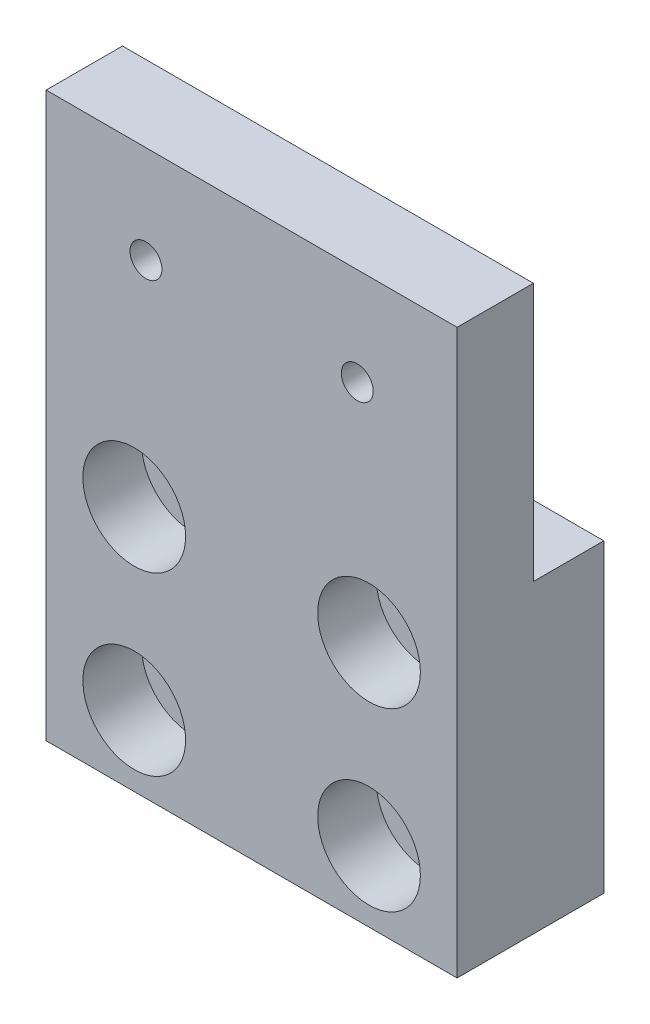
from build123d import *

# Parameters (mm, degrees)
SKETCH1_W                                        = 44.45
SKETCH1_H                                        = 60.96
BOSS_EXTRUDE1_DEPTH                              = 7.9375
CBORE_FOR_1_4_SOCKET_HEAD_CAP_SCREW1_D           = 6.7564
CBORE_FOR_1_4_SOCKET_HEAD_CAP_SCREW1_CBORE_D     = 11.1125
CBORE_FOR_1_4_SOCKET_HEAD_CAP_SCREW1_CBORE_DEPTH = 6.35
SKETCH4_W                                        = 7.62
SKETCH4_H                                        = 27.94
CUT_EXTRUDE1_DEPTH                               = 55.477856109
F_8_32_TAPPED_HOLE1_D                            = 3.4544


with BuildPart() as part:
    # Sketch1 → Boss-Extrude1 (new, symmetric)
    with BuildSketch(Plane.XY):
        Rectangle(SKETCH1_W, SKETCH1_H)
    extrude(amount=BOSS_EXTRUDE1_DEPTH, both=True)

    # CBORE for 1_4 Socket Head Cap Screw1 (through all)
    with Locations(Plane.XY.offset(7.9375)):
        with Locations((-12.7, -3.81), (12.7, -3.81), (12.7, -22.86), (-12.7, -22.86)):
            CounterBoreHole(CBORE_FOR_1_4_SOCKET_HEAD_CAP_SCREW1_D / 2, CBORE_FOR_1_4_SOCKET_HEAD_CAP_SCREW1_CBORE_D / 2, CBORE_FOR_1_4_SOCKET_HEAD_CAP_SCREW1_CBORE_DEPTH)

    # Sketch4 → Cut-Extrude1 (cut, through all)
    with BuildSketch(Plane(origin=(22.225, 0, 0), x_dir=(0, 0, -1), z_dir=(1, 0, 0))):
        with Locations((4.1275, 16.51)):
            Rectangle(SKETCH4_W, SKETCH4_H)
    extrude(amount=-CUT_EXTRUDE1_DEPTH, mode=Mode.SUBTRACT)

    # 8-32 Tapped Hole1 (through all)
    with Locations(Plane.XY.offset(7.9375)):
        with Locations((-11.43, 19.939), (11.43, 19.939)):
            Hole(F_8_32_TAPPED_HOLE1_D / 2)


solid = part.part
